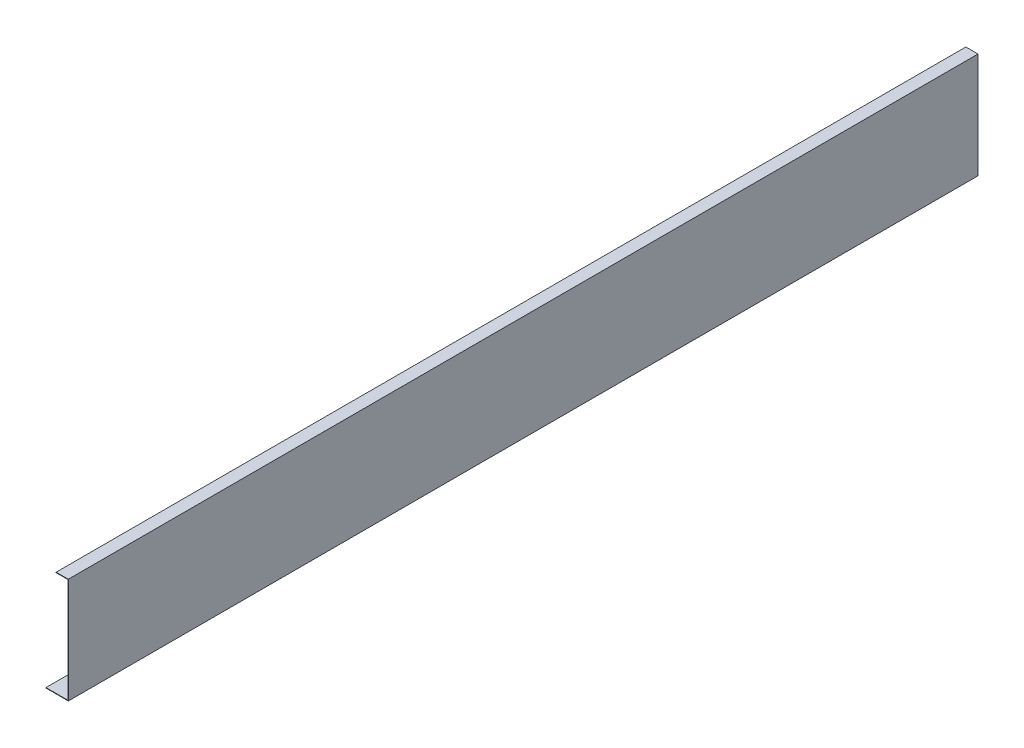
ISO-10303-21;
HEADER;
FILE_DESCRIPTION(('STEP AP214'),'2;1');
FILE_NAME('part.step','',(''),(''),'','','');
FILE_SCHEMA(('AUTOMOTIVE_DESIGN { 1 0 10303 214 1 1 1 1 }'));
ENDSEC;
DATA;
#1=APPLICATION_CONTEXT('core data for automotive mechanical design processes');
#2=APPLICATION_PROTOCOL_DEFINITION('international standard','automotive_design',2000,#1);
#3=PRODUCT_CONTEXT('',#1,'mechanical');
#4=PRODUCT('Part','Part','',(#3));
#5=PRODUCT_RELATED_PRODUCT_CATEGORY('part','',(#4));
#6=PRODUCT_DEFINITION_FORMATION('','',#4);
#7=PRODUCT_DEFINITION_CONTEXT('part definition',#1,'design');
#8=PRODUCT_DEFINITION('design','',#6,#7);
#9=PRODUCT_DEFINITION_SHAPE('','',#8);
#10=(LENGTH_UNIT() NAMED_UNIT(*) SI_UNIT(.MILLI.,.METRE.));
#11=(NAMED_UNIT(*) PLANE_ANGLE_UNIT() SI_UNIT($,.RADIAN.));
#12=(NAMED_UNIT(*) SI_UNIT($,.STERADIAN.) SOLID_ANGLE_UNIT());
#13=UNCERTAINTY_MEASURE_WITH_UNIT(LENGTH_MEASURE(1.E-05),#10,'distance_accuracy_value','');
#14=(GEOMETRIC_REPRESENTATION_CONTEXT(3) GLOBAL_UNCERTAINTY_ASSIGNED_CONTEXT((#13)) GLOBAL_UNIT_ASSIGNED_CONTEXT((#10,
#11,#12)) REPRESENTATION_CONTEXT('',''));
#15=CARTESIAN_POINT('',(0.,0.,0.));
#16=DIRECTION('',(0.,0.,1.));
#17=DIRECTION('',(1.,0.,0.));
#18=AXIS2_PLACEMENT_3D('',#15,#16,#17);
#19=CARTESIAN_POINT('',(0.,20.,1121.02));
#20=DIRECTION('',(1.,0.,0.));
#21=DIRECTION('',(0.,0.,-1.));
#22=AXIS2_PLACEMENT_3D('',#19,#20,#21);
#23=PLANE('',#22);
#24=DIRECTION('',(0.,0.,-1.));
#25=VECTOR('',#24,1.);
#26=CARTESIAN_POINT('',(0.,20.,1121.02));
#27=LINE('',#26,#25);
#28=CARTESIAN_POINT('',(0.,20.,1088.52));
#29=VERTEX_POINT('',#28);
#30=CARTESIAN_POINT('',(0.,20.,32.5));
#31=VERTEX_POINT('',#30);
#32=EDGE_CURVE('E174',#29,#31,#27,.T.);
#33=ORIENTED_EDGE('',*,*,#32,.T.);
#34=DIRECTION('',(0.,-1.,0.));
#35=VECTOR('',#34,1.);
#36=CARTESIAN_POINT('',(0.,130.,32.5));
#37=LINE('',#36,#35);
#38=CARTESIAN_POINT('',(0.,0.,32.5));
#39=VERTEX_POINT('',#38);
#40=EDGE_CURVE('E222',#31,#39,#37,.T.);
#41=ORIENTED_EDGE('',*,*,#40,.T.);
#42=DIRECTION('',(0.,0.,-1.));
#43=VECTOR('',#42,1.);
#44=CARTESIAN_POINT('',(0.,0.,1121.02));
#45=LINE('',#44,#43);
#46=CARTESIAN_POINT('',(0.,0.,1088.52));
#47=VERTEX_POINT('',#46);
#48=EDGE_CURVE('E200',#47,#39,#45,.T.);
#49=ORIENTED_EDGE('',*,*,#48,.F.);
#50=DIRECTION('',(0.,-1.,0.));
#51=VECTOR('',#50,1.);
#52=CARTESIAN_POINT('',(0.,130.,1088.52));
#53=LINE('',#52,#51);
#54=EDGE_CURVE('E230',#29,#47,#53,.T.);
#55=ORIENTED_EDGE('',*,*,#54,.F.);
#56=EDGE_LOOP('',(#33,#41,#49,#55));
#57=FACE_BOUND('',#56,.T.);
#58=ADVANCED_FACE('F33',(#57),#23,.F.);
#59=CARTESIAN_POINT('',(0.,0.,1121.02));
#60=DIRECTION('',(0.,1.,0.));
#61=DIRECTION('',(0.,0.,1.));
#62=AXIS2_PLACEMENT_3D('',#59,#60,#61);
#63=PLANE('',#62);
#64=ORIENTED_EDGE('',*,*,#48,.T.);
#65=DIRECTION('',(-1.,0.,0.));
#66=VECTOR('',#65,1.);
#67=CARTESIAN_POINT('',(0.,0.,32.5));
#68=LINE('',#67,#66);
#69=CARTESIAN_POINT('',(2.5,0.,32.5));
#70=VERTEX_POINT('',#69);
#71=EDGE_CURVE('E147',#70,#39,#68,.T.);
#72=ORIENTED_EDGE('',*,*,#71,.F.);
#73=DIRECTION('',(0.,0.,1.));
#74=VECTOR('',#73,1.);
#75=CARTESIAN_POINT('',(2.5,0.,0.));
#76=LINE('',#75,#74);
#77=CARTESIAN_POINT('',(2.5,0.,0.));
#78=VERTEX_POINT('',#77);
#79=EDGE_CURVE('E134',#78,#70,#76,.T.);
#80=ORIENTED_EDGE('',*,*,#79,.F.);
#81=DIRECTION('',(1.,0.,0.));
#82=VECTOR('',#81,1.);
#83=CARTESIAN_POINT('',(0.,0.,0.));
#84=LINE('',#83,#82);
#85=CARTESIAN_POINT('',(30.,0.,0.));
#86=VERTEX_POINT('',#85);
#87=EDGE_CURVE('E145',#78,#86,#84,.T.);
#88=ORIENTED_EDGE('',*,*,#87,.T.);
#89=DIRECTION('',(0.,0.,-1.));
#90=VECTOR('',#89,1.);
#91=CARTESIAN_POINT('',(30.,0.,1121.02));
#92=LINE('',#91,#90);
#93=CARTESIAN_POINT('',(30.,0.,1121.02));
#94=VERTEX_POINT('',#93);
#95=EDGE_CURVE('E198',#94,#86,#92,.T.);
#96=ORIENTED_EDGE('',*,*,#95,.F.);
#97=DIRECTION('',(1.,0.,0.));
#98=VECTOR('',#97,1.);
#99=CARTESIAN_POINT('',(0.,0.,1121.02));
#100=LINE('',#99,#98);
#101=CARTESIAN_POINT('',(2.5,0.,1121.02));
#102=VERTEX_POINT('',#101);
#103=EDGE_CURVE('E173',#102,#94,#100,.T.);
#104=ORIENTED_EDGE('',*,*,#103,.F.);
#105=DIRECTION('',(0.,0.,1.));
#106=VECTOR('',#105,1.);
#107=CARTESIAN_POINT('',(2.5,0.,1088.52));
#108=LINE('',#107,#106);
#109=CARTESIAN_POINT('',(2.5,0.,1088.52));
#110=VERTEX_POINT('',#109);
#111=EDGE_CURVE('E55',#110,#102,#108,.T.);
#112=ORIENTED_EDGE('',*,*,#111,.F.);
#113=DIRECTION('',(1.,0.,0.));
#114=VECTOR('',#113,1.);
#115=CARTESIAN_POINT('',(2.5,0.,1088.52));
#116=LINE('',#115,#114);
#117=EDGE_CURVE('E227',#47,#110,#116,.T.);
#118=ORIENTED_EDGE('',*,*,#117,.F.);
#119=EDGE_LOOP('',(#64,#72,#80,#88,#96,#104,#112,#118));
#120=FACE_BOUND('',#119,.T.);
#121=ADVANCED_FACE('F143',(#120),#63,.F.);
#122=CARTESIAN_POINT('',(30.,0.,1121.02));
#123=DIRECTION('',(-1.,0.,0.));
#124=DIRECTION('',(0.,0.,1.));
#125=AXIS2_PLACEMENT_3D('',#122,#123,#124);
#126=PLANE('',#125);
#127=DIRECTION('',(0.,1.,0.));
#128=VECTOR('',#127,1.);
#129=CARTESIAN_POINT('',(30.,0.,0.));
#130=LINE('',#129,#128);
#131=CARTESIAN_POINT('',(30.,130.,0.));
#132=VERTEX_POINT('',#131);
#133=EDGE_CURVE('E152',#86,#132,#130,.T.);
#134=ORIENTED_EDGE('',*,*,#133,.T.);
#135=DIRECTION('',(0.,0.,-1.));
#136=VECTOR('',#135,1.);
#137=CARTESIAN_POINT('',(30.,130.,1121.02));
#138=LINE('',#137,#136);
#139=CARTESIAN_POINT('',(30.,130.,1121.02));
#140=VERTEX_POINT('',#139);
#141=EDGE_CURVE('E195',#140,#132,#138,.T.);
#142=ORIENTED_EDGE('',*,*,#141,.F.);
#143=DIRECTION('',(0.,1.,0.));
#144=VECTOR('',#143,1.);
#145=CARTESIAN_POINT('',(30.,0.,1121.02));
#146=LINE('',#145,#144);
#147=EDGE_CURVE('E239',#94,#140,#146,.T.);
#148=ORIENTED_EDGE('',*,*,#147,.F.);
#149=ORIENTED_EDGE('',*,*,#95,.T.);
#150=EDGE_LOOP('',(#134,#142,#148,#149));
#151=FACE_BOUND('',#150,.T.);
#152=ADVANCED_FACE('F266',(#151),#126,.F.);
#153=CARTESIAN_POINT('',(30.,130.,1121.02));
#154=DIRECTION('',(0.,-1.,0.));
#155=DIRECTION('',(0.,0.,-1.));
#156=AXIS2_PLACEMENT_3D('',#153,#154,#155);
#157=PLANE('',#156);
#158=DIRECTION('',(-1.,0.,0.));
#159=VECTOR('',#158,1.);
#160=CARTESIAN_POINT('',(30.,130.,0.));
#161=LINE('',#160,#159);
#162=CARTESIAN_POINT('',(15.,130.,0.));
#163=VERTEX_POINT('',#162);
#164=EDGE_CURVE('E155',#132,#163,#161,.T.);
#165=ORIENTED_EDGE('',*,*,#164,.T.);
#166=DIRECTION('',(0.,0.,-1.));
#167=VECTOR('',#166,1.);
#168=CARTESIAN_POINT('',(15.,130.,1121.02));
#169=LINE('',#168,#167);
#170=CARTESIAN_POINT('',(15.,130.,1121.02));
#171=VERTEX_POINT('',#170);
#172=EDGE_CURVE('E192',#171,#163,#169,.T.);
#173=ORIENTED_EDGE('',*,*,#172,.F.);
#174=DIRECTION('',(-1.,0.,0.));
#175=VECTOR('',#174,1.);
#176=CARTESIAN_POINT('',(30.,130.,1121.02));
#177=LINE('',#176,#175);
#178=EDGE_CURVE('E241',#140,#171,#177,.T.);
#179=ORIENTED_EDGE('',*,*,#178,.F.);
#180=ORIENTED_EDGE('',*,*,#141,.T.);
#181=EDGE_LOOP('',(#165,#173,#179,#180));
#182=FACE_BOUND('',#181,.T.);
#183=ADVANCED_FACE('F268',(#182),#157,.F.);
#184=CARTESIAN_POINT('',(15.,130.,1121.02));
#185=DIRECTION('',(1.,0.,0.));
#186=DIRECTION('',(0.,0.,-1.));
#187=AXIS2_PLACEMENT_3D('',#184,#185,#186);
#188=PLANE('',#187);
#189=DIRECTION('',(0.,-1.,0.));
#190=VECTOR('',#189,1.);
#191=CARTESIAN_POINT('',(15.,130.,0.));
#192=LINE('',#191,#190);
#193=CARTESIAN_POINT('',(15.,129.35,0.));
#194=VERTEX_POINT('',#193);
#195=EDGE_CURVE('E165',#163,#194,#192,.T.);
#196=ORIENTED_EDGE('',*,*,#195,.T.);
#197=DIRECTION('',(0.,0.,-1.));
#198=VECTOR('',#197,1.);
#199=CARTESIAN_POINT('',(15.,129.35,1121.02));
#200=LINE('',#199,#198);
#201=CARTESIAN_POINT('',(15.,129.35,1121.02));
#202=VERTEX_POINT('',#201);
#203=EDGE_CURVE('E189',#202,#194,#200,.T.);
#204=ORIENTED_EDGE('',*,*,#203,.F.);
#205=DIRECTION('',(0.,-1.,0.));
#206=VECTOR('',#205,1.);
#207=CARTESIAN_POINT('',(15.,130.,1121.02));
#208=LINE('',#207,#206);
#209=EDGE_CURVE('E243',#171,#202,#208,.T.);
#210=ORIENTED_EDGE('',*,*,#209,.F.);
#211=ORIENTED_EDGE('',*,*,#172,.T.);
#212=EDGE_LOOP('',(#196,#204,#210,#211));
#213=FACE_BOUND('',#212,.T.);
#214=ADVANCED_FACE('F273',(#213),#188,.F.);
#215=CARTESIAN_POINT('',(15.,129.35,1121.02));
#216=DIRECTION('',(0.,1.,0.));
#217=DIRECTION('',(0.,0.,1.));
#218=AXIS2_PLACEMENT_3D('',#215,#216,#217);
#219=PLANE('',#218);
#220=DIRECTION('',(1.,0.,0.));
#221=VECTOR('',#220,1.);
#222=CARTESIAN_POINT('',(15.,129.35,0.));
#223=LINE('',#222,#221);
#224=CARTESIAN_POINT('',(29.35,129.35,0.));
#225=VERTEX_POINT('',#224);
#226=EDGE_CURVE('E167',#194,#225,#223,.T.);
#227=ORIENTED_EDGE('',*,*,#226,.T.);
#228=DIRECTION('',(0.,0.,-1.));
#229=VECTOR('',#228,1.);
#230=CARTESIAN_POINT('',(29.35,129.35,1121.02));
#231=LINE('',#230,#229);
#232=CARTESIAN_POINT('',(29.35,129.35,1121.02));
#233=VERTEX_POINT('',#232);
#234=EDGE_CURVE('E186',#233,#225,#231,.T.);
#235=ORIENTED_EDGE('',*,*,#234,.F.);
#236=DIRECTION('',(1.,0.,0.));
#237=VECTOR('',#236,1.);
#238=CARTESIAN_POINT('',(15.,129.35,1121.02));
#239=LINE('',#238,#237);
#240=EDGE_CURVE('E245',#202,#233,#239,.T.);
#241=ORIENTED_EDGE('',*,*,#240,.F.);
#242=ORIENTED_EDGE('',*,*,#203,.T.);
#243=EDGE_LOOP('',(#227,#235,#241,#242));
#244=FACE_BOUND('',#243,.T.);
#245=ADVANCED_FACE('F277',(#244),#219,.F.);
#246=CARTESIAN_POINT('',(29.35,129.35,1121.02));
#247=DIRECTION('',(1.,0.,0.));
#248=DIRECTION('',(0.,1.,0.));
#249=AXIS2_PLACEMENT_3D('',#246,#247,#248);
#250=PLANE('',#249);
#251=DIRECTION('',(0.,-1.,0.));
#252=VECTOR('',#251,1.);
#253=CARTESIAN_POINT('',(29.35,129.35,0.));
#254=LINE('',#253,#252);
#255=CARTESIAN_POINT('',(29.35,0.650000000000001,0.));
#256=VERTEX_POINT('',#255);
#257=EDGE_CURVE('E169',#225,#256,#254,.T.);
#258=ORIENTED_EDGE('',*,*,#257,.T.);
#259=DIRECTION('',(0.,0.,-1.));
#260=VECTOR('',#259,1.);
#261=CARTESIAN_POINT('',(29.35,0.650000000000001,1121.02));
#262=LINE('',#261,#260);
#263=CARTESIAN_POINT('',(29.35,0.650000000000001,1121.02));
#264=VERTEX_POINT('',#263);
#265=EDGE_CURVE('E183',#264,#256,#262,.T.);
#266=ORIENTED_EDGE('',*,*,#265,.F.);
#267=DIRECTION('',(0.,-1.,0.));
#268=VECTOR('',#267,1.);
#269=CARTESIAN_POINT('',(29.35,129.35,1121.02));
#270=LINE('',#269,#268);
#271=EDGE_CURVE('E246',#233,#264,#270,.T.);
#272=ORIENTED_EDGE('',*,*,#271,.F.);
#273=ORIENTED_EDGE('',*,*,#234,.T.);
#274=EDGE_LOOP('',(#258,#266,#272,#273));
#275=FACE_BOUND('',#274,.T.);
#276=ADVANCED_FACE('F281',(#275),#250,.F.);
#277=CARTESIAN_POINT('',(29.35,0.650000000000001,1121.02));
#278=DIRECTION('',(0.,-1.,0.));
#279=DIRECTION('',(1.,0.,0.));
#280=AXIS2_PLACEMENT_3D('',#277,#278,#279);
#281=PLANE('',#280);
#282=DIRECTION('',(0.,0.,1.));
#283=VECTOR('',#282,1.);
#284=CARTESIAN_POINT('',(2.5,0.649999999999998,1121.02));
#285=LINE('',#284,#283);
#286=CARTESIAN_POINT('',(2.50000000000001,0.649999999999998,0.));
#287=VERTEX_POINT('',#286);
#288=CARTESIAN_POINT('',(2.5,0.650000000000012,32.5));
#289=VERTEX_POINT('',#288);
#290=EDGE_CURVE('E47',#287,#289,#285,.T.);
#291=ORIENTED_EDGE('',*,*,#290,.T.);
#292=DIRECTION('',(-1.,0.,0.));
#293=VECTOR('',#292,1.);
#294=CARTESIAN_POINT('',(29.35,0.650000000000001,32.5));
#295=LINE('',#294,#293);
#296=CARTESIAN_POINT('',(0.650000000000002,0.649999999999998,32.5));
#297=VERTEX_POINT('',#296);
#298=EDGE_CURVE('E219',#289,#297,#295,.T.);
#299=ORIENTED_EDGE('',*,*,#298,.T.);
#300=DIRECTION('',(0.,0.,-1.));
#301=VECTOR('',#300,1.);
#302=CARTESIAN_POINT('',(0.650000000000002,0.649999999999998,1121.02));
#303=LINE('',#302,#301);
#304=CARTESIAN_POINT('',(0.650000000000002,0.649999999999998,1088.52));
#305=VERTEX_POINT('',#304);
#306=EDGE_CURVE('E180',#305,#297,#303,.T.);
#307=ORIENTED_EDGE('',*,*,#306,.F.);
#308=DIRECTION('',(1.,0.,0.));
#309=VECTOR('',#308,1.);
#310=CARTESIAN_POINT('',(29.35,0.650000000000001,1088.52));
#311=LINE('',#310,#309);
#312=CARTESIAN_POINT('',(2.5,0.650000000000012,1088.52));
#313=VERTEX_POINT('',#312);
#314=EDGE_CURVE('E153',#305,#313,#311,.T.);
#315=ORIENTED_EDGE('',*,*,#314,.T.);
#316=DIRECTION('',(0.,0.,1.));
#317=VECTOR('',#316,1.);
#318=CARTESIAN_POINT('',(2.5,0.649999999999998,1121.02));
#319=LINE('',#318,#317);
#320=CARTESIAN_POINT('',(2.5,0.650000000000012,1121.02));
#321=VERTEX_POINT('',#320);
#322=EDGE_CURVE('E233',#313,#321,#319,.T.);
#323=ORIENTED_EDGE('',*,*,#322,.T.);
#324=DIRECTION('',(-1.,0.,0.));
#325=VECTOR('',#324,1.);
#326=CARTESIAN_POINT('',(29.35,0.650000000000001,1121.02));
#327=LINE('',#326,#325);
#328=EDGE_CURVE('E161',#264,#321,#327,.T.);
#329=ORIENTED_EDGE('',*,*,#328,.F.);
#330=ORIENTED_EDGE('',*,*,#265,.T.);
#331=DIRECTION('',(-1.,0.,0.));
#332=VECTOR('',#331,1.);
#333=CARTESIAN_POINT('',(29.35,0.650000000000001,0.));
#334=LINE('',#333,#332);
#335=EDGE_CURVE('E171',#256,#287,#334,.T.);
#336=ORIENTED_EDGE('',*,*,#335,.T.);
#337=EDGE_LOOP('',(#291,#299,#307,#315,#323,#329,#330,#336));
#338=FACE_BOUND('',#337,.T.);
#339=ADVANCED_FACE('F255',(#338),#281,.F.);
#340=CARTESIAN_POINT('',(0.65,20.,1121.02));
#341=DIRECTION('',(-1.,0.,0.));
#342=DIRECTION('',(0.,-1.,0.));
#343=AXIS2_PLACEMENT_3D('',#340,#341,#342);
#344=PLANE('',#343);
#345=ORIENTED_EDGE('',*,*,#306,.T.);
#346=DIRECTION('',(0.,1.,0.));
#347=VECTOR('',#346,1.);
#348=CARTESIAN_POINT('',(0.65,20.,32.5));
#349=LINE('',#348,#347);
#350=CARTESIAN_POINT('',(0.65,20.,32.5));
#351=VERTEX_POINT('',#350);
#352=EDGE_CURVE('E216',#297,#351,#349,.T.);
#353=ORIENTED_EDGE('',*,*,#352,.T.);
#354=DIRECTION('',(0.,0.,-1.));
#355=VECTOR('',#354,1.);
#356=CARTESIAN_POINT('',(0.65,20.,1121.02));
#357=LINE('',#356,#355);
#358=CARTESIAN_POINT('',(0.65,20.,1088.52));
#359=VERTEX_POINT('',#358);
#360=EDGE_CURVE('E177',#359,#351,#357,.T.);
#361=ORIENTED_EDGE('',*,*,#360,.F.);
#362=DIRECTION('',(0.,-1.,0.));
#363=VECTOR('',#362,1.);
#364=CARTESIAN_POINT('',(0.65,20.,1088.52));
#365=LINE('',#364,#363);
#366=EDGE_CURVE('E158',#359,#305,#365,.T.);
#367=ORIENTED_EDGE('',*,*,#366,.T.);
#368=EDGE_LOOP('',(#345,#353,#361,#367));
#369=FACE_BOUND('',#368,.T.);
#370=ADVANCED_FACE('F214',(#369),#344,.F.);
#371=CARTESIAN_POINT('',(0.,20.,1121.02));
#372=DIRECTION('',(0.,-1.,0.));
#373=DIRECTION('',(0.,0.,-1.));
#374=AXIS2_PLACEMENT_3D('',#371,#372,#373);
#375=PLANE('',#374);
#376=ORIENTED_EDGE('',*,*,#360,.T.);
#377=DIRECTION('',(-1.,0.,0.));
#378=VECTOR('',#377,1.);
#379=CARTESIAN_POINT('',(0.,20.,32.5));
#380=LINE('',#379,#378);
#381=EDGE_CURVE('E11',#351,#31,#380,.T.);
#382=ORIENTED_EDGE('',*,*,#381,.T.);
#383=ORIENTED_EDGE('',*,*,#32,.F.);
#384=DIRECTION('',(1.,0.,0.));
#385=VECTOR('',#384,1.);
#386=CARTESIAN_POINT('',(0.,20.,1088.52));
#387=LINE('',#386,#385);
#388=EDGE_CURVE('E140',#29,#359,#387,.T.);
#389=ORIENTED_EDGE('',*,*,#388,.T.);
#390=EDGE_LOOP('',(#376,#382,#383,#389));
#391=FACE_BOUND('',#390,.T.);
#392=ADVANCED_FACE('F208',(#391),#375,.F.);
#393=CARTESIAN_POINT('',(0.,0.,1121.02));
#394=DIRECTION('',(0.,0.,1.));
#395=DIRECTION('',(1.,0.,0.));
#396=AXIS2_PLACEMENT_3D('',#393,#394,#395);
#397=PLANE('',#396);
#398=DIRECTION('',(0.,1.,0.));
#399=VECTOR('',#398,1.);
#400=CARTESIAN_POINT('',(2.5,0.,1121.02));
#401=LINE('',#400,#399);
#402=EDGE_CURVE('E202',#102,#321,#401,.T.);
#403=ORIENTED_EDGE('',*,*,#402,.F.);
#404=ORIENTED_EDGE('',*,*,#103,.T.);
#405=ORIENTED_EDGE('',*,*,#147,.T.);
#406=ORIENTED_EDGE('',*,*,#178,.T.);
#407=ORIENTED_EDGE('',*,*,#209,.T.);
#408=ORIENTED_EDGE('',*,*,#240,.T.);
#409=ORIENTED_EDGE('',*,*,#271,.T.);
#410=ORIENTED_EDGE('',*,*,#328,.T.);
#411=EDGE_LOOP('',(#403,#404,#405,#406,#407,#408,#409,#410));
#412=FACE_BOUND('',#411,.T.);
#413=ADVANCED_FACE('F252',(#412),#397,.T.);
#414=CARTESIAN_POINT('',(0.,0.,0.));
#415=DIRECTION('',(0.,0.,1.));
#416=DIRECTION('',(1.,0.,0.));
#417=AXIS2_PLACEMENT_3D('',#414,#415,#416);
#418=PLANE('',#417);
#419=ORIENTED_EDGE('',*,*,#87,.F.);
#420=DIRECTION('',(0.,1.,0.));
#421=VECTOR('',#420,1.);
#422=CARTESIAN_POINT('',(2.5,0.,0.));
#423=LINE('',#422,#421);
#424=EDGE_CURVE('E40',#78,#287,#423,.T.);
#425=ORIENTED_EDGE('',*,*,#424,.T.);
#426=ORIENTED_EDGE('',*,*,#335,.F.);
#427=ORIENTED_EDGE('',*,*,#257,.F.);
#428=ORIENTED_EDGE('',*,*,#226,.F.);
#429=ORIENTED_EDGE('',*,*,#195,.F.);
#430=ORIENTED_EDGE('',*,*,#164,.F.);
#431=ORIENTED_EDGE('',*,*,#133,.F.);
#432=EDGE_LOOP('',(#419,#425,#426,#427,#428,#429,#430,#431));
#433=FACE_BOUND('',#432,.T.);
#434=ADVANCED_FACE('F150',(#433),#418,.F.);
#435=CARTESIAN_POINT('',(2.5,130.,1088.52));
#436=DIRECTION('',(0.,0.,-1.));
#437=DIRECTION('',(-1.,0.,0.));
#438=AXIS2_PLACEMENT_3D('',#435,#436,#437);
#439=PLANE('',#438);
#440=ORIENTED_EDGE('',*,*,#366,.F.);
#441=ORIENTED_EDGE('',*,*,#388,.F.);
#442=ORIENTED_EDGE('',*,*,#54,.T.);
#443=ORIENTED_EDGE('',*,*,#117,.T.);
#444=DIRECTION('',(0.,-1.,0.));
#445=VECTOR('',#444,1.);
#446=CARTESIAN_POINT('',(2.5,130.,1088.52));
#447=LINE('',#446,#445);
#448=EDGE_CURVE('E231',#313,#110,#447,.T.);
#449=ORIENTED_EDGE('',*,*,#448,.F.);
#450=ORIENTED_EDGE('',*,*,#314,.F.);
#451=EDGE_LOOP('',(#440,#441,#442,#443,#449,#450));
#452=FACE_BOUND('',#451,.T.);
#453=ADVANCED_FACE('F258',(#452),#439,.F.);
#454=CARTESIAN_POINT('',(2.5,130.,1088.52));
#455=DIRECTION('',(1.,0.,0.));
#456=DIRECTION('',(0.,0.,-1.));
#457=AXIS2_PLACEMENT_3D('',#454,#455,#456);
#458=PLANE('',#457);
#459=ORIENTED_EDGE('',*,*,#448,.T.);
#460=ORIENTED_EDGE('',*,*,#111,.T.);
#461=ORIENTED_EDGE('',*,*,#402,.T.);
#462=ORIENTED_EDGE('',*,*,#322,.F.);
#463=EDGE_LOOP('',(#459,#460,#461,#462));
#464=FACE_BOUND('',#463,.T.);
#465=ADVANCED_FACE('F257',(#464),#458,.F.);
#466=CARTESIAN_POINT('',(0.,130.,32.5));
#467=DIRECTION('',(0.,0.,1.));
#468=DIRECTION('',(1.,0.,0.));
#469=AXIS2_PLACEMENT_3D('',#466,#467,#468);
#470=PLANE('',#469);
#471=DIRECTION('',(0.,-1.,0.));
#472=VECTOR('',#471,1.);
#473=CARTESIAN_POINT('',(2.5,130.,32.5));
#474=LINE('',#473,#472);
#475=EDGE_CURVE('E283',#289,#70,#474,.T.);
#476=ORIENTED_EDGE('',*,*,#475,.T.);
#477=ORIENTED_EDGE('',*,*,#71,.T.);
#478=ORIENTED_EDGE('',*,*,#40,.F.);
#479=ORIENTED_EDGE('',*,*,#381,.F.);
#480=ORIENTED_EDGE('',*,*,#352,.F.);
#481=ORIENTED_EDGE('',*,*,#298,.F.);
#482=EDGE_LOOP('',(#476,#477,#478,#479,#480,#481));
#483=FACE_BOUND('',#482,.T.);
#484=ADVANCED_FACE('F282',(#483),#470,.F.);
#485=CARTESIAN_POINT('',(2.5,130.,0.));
#486=DIRECTION('',(1.,0.,0.));
#487=DIRECTION('',(0.,0.,-1.));
#488=AXIS2_PLACEMENT_3D('',#485,#486,#487);
#489=PLANE('',#488);
#490=ORIENTED_EDGE('',*,*,#424,.F.);
#491=ORIENTED_EDGE('',*,*,#79,.T.);
#492=ORIENTED_EDGE('',*,*,#475,.F.);
#493=ORIENTED_EDGE('',*,*,#290,.F.);
#494=EDGE_LOOP('',(#490,#491,#492,#493));
#495=FACE_BOUND('',#494,.T.);
#496=ADVANCED_FACE('F133',(#495),#489,.F.);
#497=CLOSED_SHELL('',(#58,#121,#152,#183,#214,#245,#276,#339,#370,#392,#413,#434,#453,#465,#484,#496));
#498=MANIFOLD_SOLID_BREP('B2',#497);
#499=ADVANCED_BREP_SHAPE_REPRESENTATION('',(#18,#498),#14);
#500=SHAPE_DEFINITION_REPRESENTATION(#9,#499);
ENDSEC;
END-ISO-10303-21;
